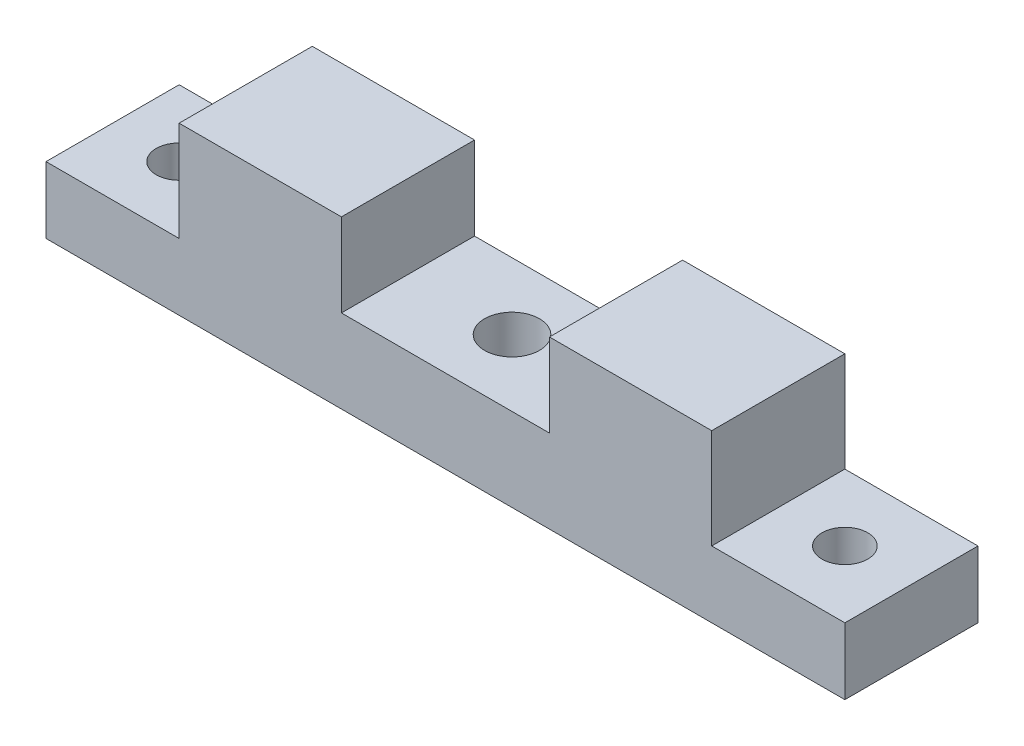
from build123d import *

# Parameters (mm, degrees)
EXTRUSION2_DEPTH     = 8
ESQUISSE4_R          = 2.75
EXTRUSION3_DEPTH     = 51.119856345
PER_AGE1_D           = 6.6
PER_AGE1_CSINK_D     = 13.8
PER_AGE1_CSINK_ANGLE = 90


with BuildPart() as part:
    # Esquisse1 → Extrusion2 (new, symmetric)
    with BuildSketch(Plane.XY):
        Polygon((48, 8), (32, 8), (32, 20), (12.5, 20), (12.5, 10), (-12.5, 10), (-12.5, 20), (-32, 20), (-32, 8), (-48, 8), (-48, 0), (48, 0), align=None)
    extrude(amount=EXTRUSION2_DEPTH, both=True)

    # Esquisse4 → Extrusion3 (cut, through all)
    with BuildSketch(Plane(origin=(0, 8, 0), x_dir=(-1, 0, 0), z_dir=(0, 1, 0))):
        with Locations(Location((-40, 0, 0), (0, 0, 90))):
            Circle(ESQUISSE4_R)
        with Locations(Location((40, 0, 0), (0, 0, 90))):
            Circle(ESQUISSE4_R)
    extrude(amount=-EXTRUSION3_DEPTH, mode=Mode.SUBTRACT)

    # Per_age1 (through all)
    with Locations(Plane.XZ):
        with Locations((0, 0)):
            CounterSinkHole(PER_AGE1_D / 2, PER_AGE1_CSINK_D / 2, counter_sink_angle=PER_AGE1_CSINK_ANGLE)


solid = part.part
